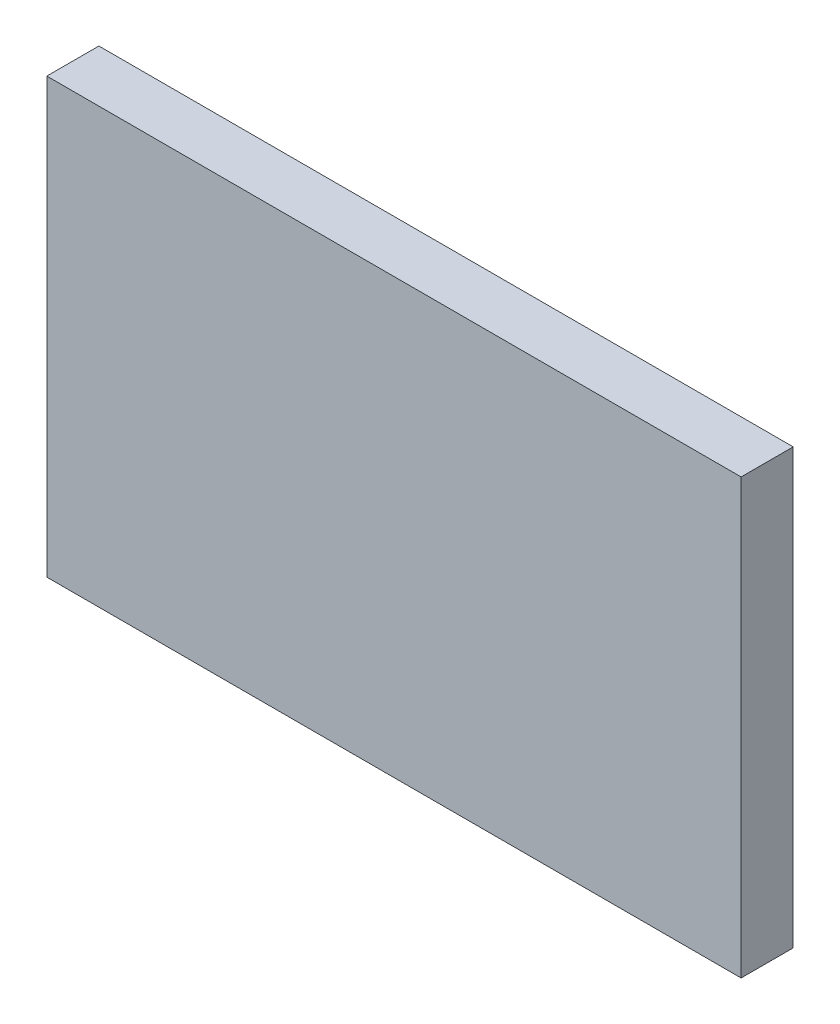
from build123d import *

# Parameters (mm, degrees)
SKETCH1_W      = 101.6
SKETCH1_H      = 63.5
EXTRUDE1_DEPTH = 7.62
SKETCH2_W      = 5.08
SKETCH2_H      = 19.24414616
SKETCH2_H_2    = 19.05
EXTRUDE2_DEPTH = 20.32
FILLET1_R      = 5.08
EXTRUDE3_REACH = 90.646
SKETCH3_R      = 6.330338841


with BuildPart() as part:
    # Sketch1 → Extrude1 (new body)
    with BuildSketch(Plane.XY):
        with Locations((50.8, 31.75)):
            Rectangle(SKETCH1_W, SKETCH1_H)
    extrude(amount=EXTRUDE1_DEPTH)

    # Sketch2 → Extrude2 (add)
    with BuildSketch(Plane(origin=(0, 0, 0), x_dir=(-1, 0, 0), z_dir=(0, 0, -1))):
        with Locations((-60.96, 31.65292692)):
            Rectangle(SKETCH2_W, SKETCH2_H)
        with Locations((-40.64, 31.75)):
            Rectangle(SKETCH2_W, SKETCH2_H_2)
    extrude(amount=EXTRUDE2_DEPTH)

    # Fillet1
    fillet1_edges = [part.edges().sort_by_distance(p)[0] for p in [
        (40.64, 41.275, 0),
        (40.64, 22.225, 0),
        (60.96, 41.275, 0),
        (60.96, 22.03085384, 0),
        (40.64, 41.275, -20.32),
        (40.64, 22.225, -20.32),
        (60.96, 41.275, -20.32),
        (60.96, 22.03085384, -20.32),
    ]]
    fillet(fillet1_edges, radius=FILLET1_R)

    # Sketch3 → Extrude3 (add, up to next)
    with BuildSketch(Plane.ZY.offset(-58.42), mode=Mode.PRIVATE) as extrude3_sk1:
        with Locations(Location((-12.7, 31.75, 0), (0, 0, 180))):
            Circle(SKETCH3_R)
    extrude3_tool1 = extrude(extrude3_sk1.sketch, amount=EXTRUDE3_REACH, mode=Mode.PRIVATE) - part.part
    add(extrude3_tool1.solids().sort_by_distance((58.42, 31.75, -12.7))[0])


solid = part.part
